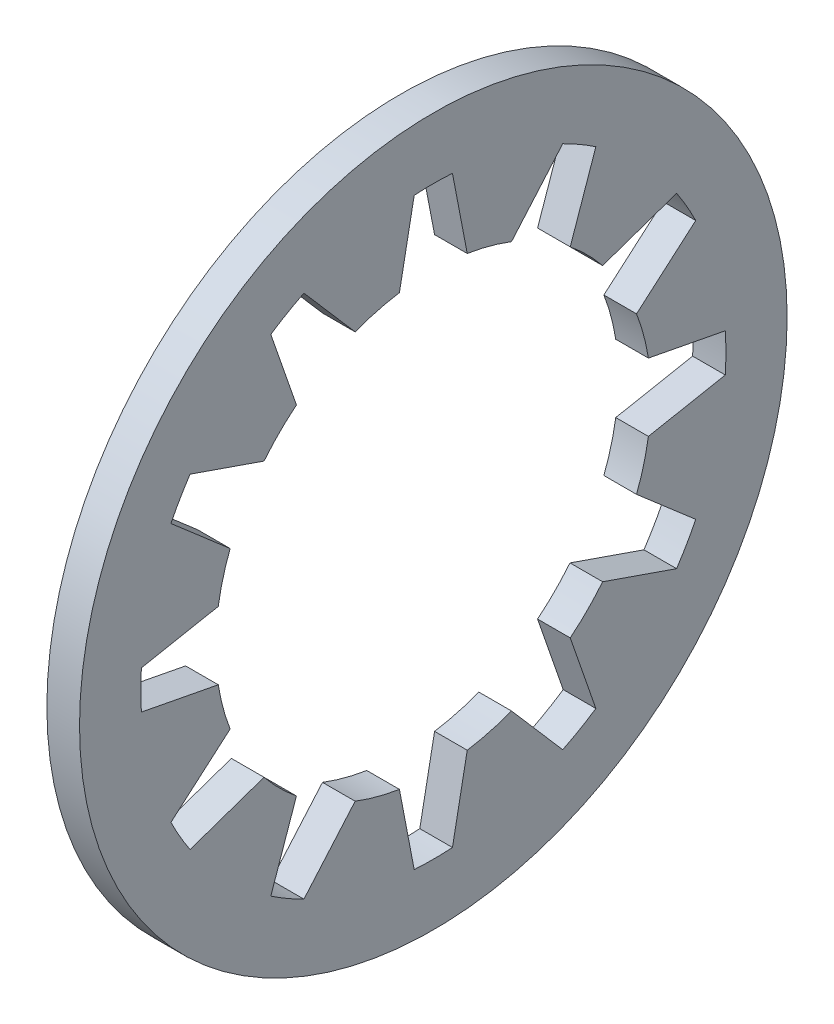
from build123d import *

# Parameters (mm, degrees)
SECSKE_W      = 1.2
SECSKE_H      = 5
INTCUT_DEPTH  = 19.423897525
INTCUTS_COUNT = 12
INTCUTS_ANGLE = 330


with BuildPart() as part:
    # SecSke → Body (revolve)
    with BuildSketch(Plane.XY, mode=Mode.PRIVATE) as body_sk:
        with Locations((-0.6, 10.5)):
            Rectangle(SECSKE_W, SECSKE_H)
    revolve(body_sk.sketch.rotate(Axis((-34.925, 0, 0), (1, 0, 0)), 90), axis=Axis((-34.925, 0, 0), (1, 0, 0)))

    # IntCutSke → IntCut (cut, through all)
    with BuildSketch(Plane(origin=(0, 0, 0), x_dir=(0, 0, -1), z_dir=(1, 0, 0))):
        with BuildLine():
            Line((-0.703083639, 10.726983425), (-1.326257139, 7.483384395))
            ThreePointArc((-1.326257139, 7.483384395), (0, 7.6), (1.326257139, 7.483384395))
            Line((1.326257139, 7.483384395), (0.703083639, 10.726983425))
            ThreePointArc((0.703083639, 10.726983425), (0, 10.75), (-0.703083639, 10.726983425))
        make_face()
    intcut = extrude(amount=-INTCUT_DEPTH, mode=Mode.SUBTRACT)

    # IntCuts: IntCut ×12 about axis
    intcuts_axis = Axis((-34.925, 0, 0), (1, 0, 0))
    for i in range(1, INTCUTS_COUNT):
        add(intcut.rotate(intcuts_axis, i * INTCUTS_ANGLE / (INTCUTS_COUNT - 1)), mode=Mode.SUBTRACT)


solid = part.part
